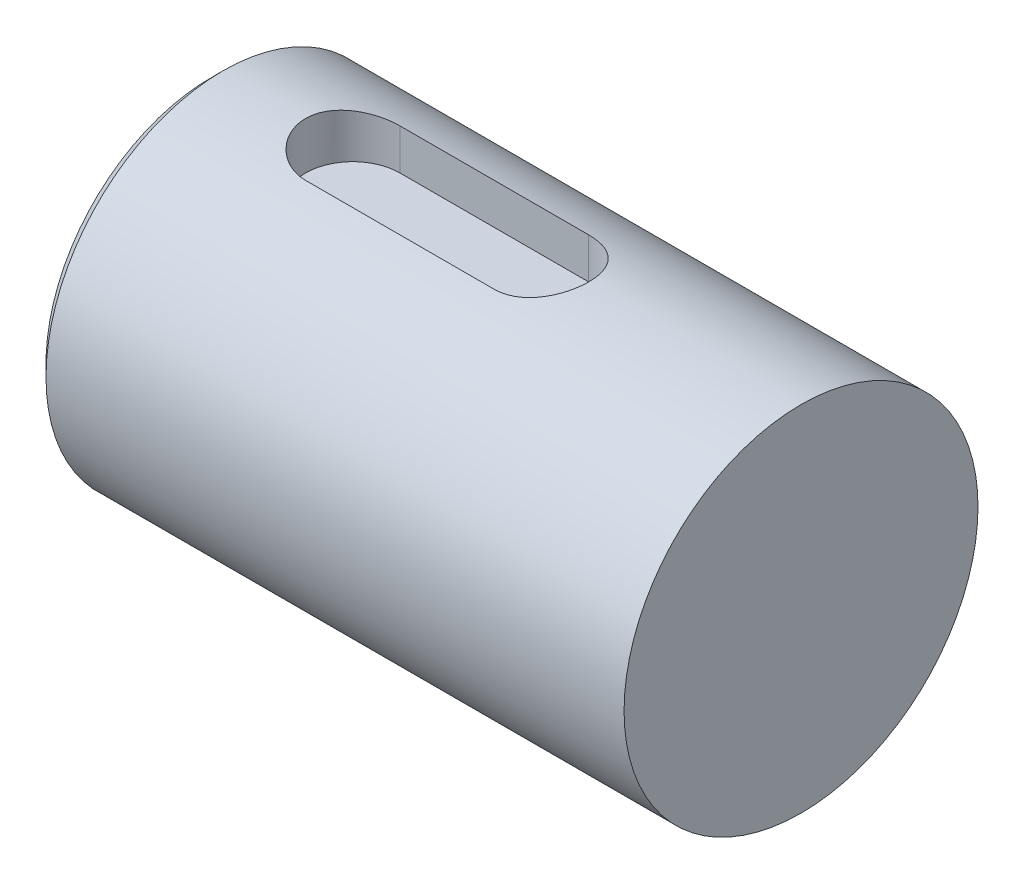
from build123d import *

# Parameters (mm, degrees)
ESQUISSE1_W             = 50
ESQUISSE1_H             = 15
CHANFREIN1_SIZE         = 1
ENL_V_MAT_EXTRU_1_DEPTH = 4


with BuildPart() as part:
    # Esquisse1 → R_volution1 (revolve)
    with BuildSketch(Plane.XY, mode=Mode.PRIVATE) as r_volution1_sk:
        with Locations((25, 7.5)):
            Rectangle(ESQUISSE1_W, ESQUISSE1_H)
    revolve(r_volution1_sk.sketch.rotate(Axis((0, 0, 0), (1, 0, 0)), 90), axis=Axis((0, 0, 0), (1, 0, 0)))

    # Chanfrein1
    chanfrein1_edges = [part.edges().sort_by_distance(p)[0] for p in [
        (0, 0, -15),
    ]]
    chamfer(chanfrein1_edges, length=CHANFREIN1_SIZE)

    # Esquisse2 → Enl_v. mat.-Extru.1 (cut)
    with BuildSketch(Plane(origin=(0, 15, 0), x_dir=(-1, 0, 0), z_dir=(0, 1, 0))):
        with BuildLine():
            Line((-28, 4), (-12, 4))
            ThreePointArc((-12, 4), (-8, 0), (-12, -4))
            Line((-12, -4), (-28, -4))
            ThreePointArc((-28, -4), (-32, 0), (-28, 4))
        make_face()
    extrude(amount=-ENL_V_MAT_EXTRU_1_DEPTH, mode=Mode.SUBTRACT)


solid = part.part
